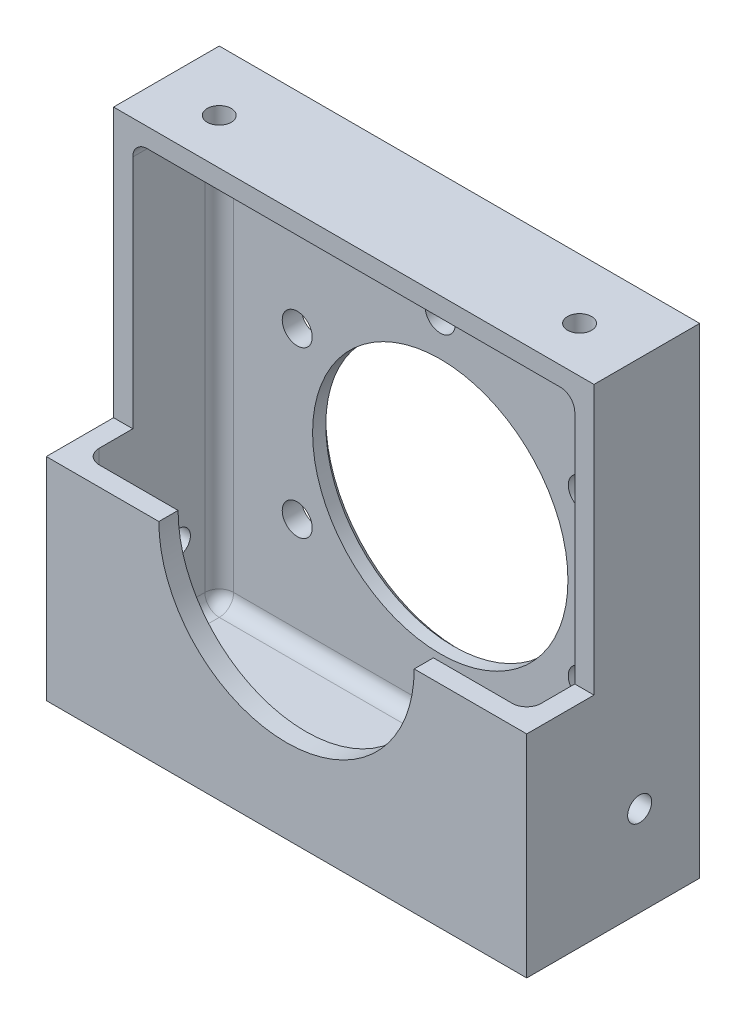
from build123d import *

# Parameters (mm, degrees)
SKETCH1_W            = 50.8
SKETCH1_H            = 50.8
MAIN_BODY_DEPTH      = 18.288
SKETCH2_W            = 7.112
SKETCH2_H            = 28.448
FRONT_CUT_DEPTH      = 75.133197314
SHELL1_T             = -2.032
SKETCH3_R            = 13.5001
CENTER_HOLE_DEPTH    = 75.133197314
FILL060_VERT_R       = 1.524
FILL060_TB_R         = 1.524
CHAM025_SIZE         = 0.635
DRILL010_TOP_REACH   = 76.133
SKETCH4_R            = 1.27
SKETCH6_R            = 1.27
DRILL010_SIDES_DEPTH = 75.133197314
DRILL125_REACH       = 76.133
SKETCH9_R            = 1.5875
HOLE_PATTERN_COUNT   = 6


with BuildPart() as part:
    # Sketch1 → main body (new body)
    with BuildSketch(Plane.XY):
        with Locations((25.4, 25.4)):
            Rectangle(SKETCH1_W, SKETCH1_H)
    extrude(amount=MAIN_BODY_DEPTH)

    # Sketch2 → front cut (cut, through all)
    with BuildSketch(Plane(origin=(50.8, 0, 0), x_dir=(0, 0, -1), z_dir=(1, 0, 0))):
        with Locations((-14.732, 36.576)):
            Rectangle(SKETCH2_W, SKETCH2_H)
    extrude(amount=-FRONT_CUT_DEPTH, mode=Mode.SUBTRACT)

    # Shell1
    shell1_openings = [part.faces().sort_by_distance(p)[0] for p in [
        (25.4, 36.576, 11.176),
        (25.4, 22.352, 14.732),
    ]]
    offset(amount=SHELL1_T, openings=shell1_openings, kind=Kind.INTERSECTION)

    # Sketch3 → center hole (cut, through all)
    with BuildSketch(Plane.XY):
        with Locations(Location((25.4, 22.352, 0), (0, 0, 180))):
            Circle(SKETCH3_R)
    extrude(amount=CENTER_HOLE_DEPTH, mode=Mode.SUBTRACT)

    # fill060.vert
    fill060_vert_edges = [part.edges().sort_by_distance(p)[0] for p in [
        (2.032, 12.192, 16.256),
        (48.768, 12.192, 16.256),
        (2.032, 25.4, 2.032),
        (48.768, 25.4, 2.032),
    ]]
    fillet(fill060_vert_edges, radius=FILL060_VERT_R)

    # fill060.tb
    fill060_tb_edges = [part.edges().sort_by_distance(p)[0] for p in [
        (2.032, 48.768, 7.366),
        (48.768, 48.768, 7.366),
        (2.032, 2.032, 9.144),
        (25.4, 48.768, 2.032),
        (48.321630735, 48.768, 2.478369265),
        (2.478369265, 48.768, 2.478369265),
        (25.4, 2.032, 2.032),
        (25.4, 2.032, 16.256),
        (48.768, 2.032, 9.144),
        (48.321630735, 2.032, 15.809630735),
        (48.321630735, 2.032, 2.478369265),
        (2.478369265, 2.032, 15.809630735),
        (2.478369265, 2.032, 2.478369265),
    ]]
    fillet(fill060_tb_edges, radius=FILL060_TB_R)

    # cham025
    cham025_edges = [part.edges().sort_by_distance(p)[0] for p in [
        (38.9001, 22.352, 0),
    ]]
    chamfer(cham025_edges, length=CHAM025_SIZE)

    # Sketch4 → drill010.top (cut, up to next)
    with BuildSketch(Plane(origin=(0, 50.8, 0), x_dir=(-1, 0, 0), z_dir=(0, 1, 0)), mode=Mode.PRIVATE) as drill010_top_sk1:
        with Locations((-44.45, 6.35)):
            Circle(SKETCH4_R)
    drill010_top_tool1 = extrude(drill010_top_sk1.sketch, amount=-DRILL010_TOP_REACH, mode=Mode.PRIVATE) & part.part
    # Sketch4 → drill010.top (cut, up to next)
    with BuildSketch(Plane(origin=(0, 50.8, 0), x_dir=(-1, 0, 0), z_dir=(0, 1, 0)), mode=Mode.PRIVATE) as drill010_top_sk2:
        with Locations((-6.35, 6.35)):
            Circle(SKETCH4_R)
    drill010_top_tool2 = extrude(drill010_top_sk2.sketch, amount=-DRILL010_TOP_REACH, mode=Mode.PRIVATE) & part.part
    add(drill010_top_tool1.solids().sort_by_distance((44.45, 50.8, 6.35))[0], mode=Mode.SUBTRACT)
    add(drill010_top_tool2.solids().sort_by_distance((6.35, 50.8, 6.35))[0], mode=Mode.SUBTRACT)

    # Sketch6 → drill010.sides (cut, through all)
    with BuildSketch(Plane(origin=(50.8, 0, 0), x_dir=(0, 0, -1), z_dir=(1, 0, 0))):
        with Locations(Location((-6.35, 9.525, 0), (0, 0, 90))):
            Circle(SKETCH6_R)
    extrude(amount=-DRILL010_SIDES_DEPTH, mode=Mode.SUBTRACT)

    # Sketch9 → drill125 (cut, up to next)
    with BuildSketch(Plane(origin=(0, 0, 0), x_dir=(-1, 0, 0), z_dir=(0, 0, -1)), mode=Mode.PRIVATE) as drill125_sk1:
        with Locations((-10.277031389, 31.083250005)):
            Circle(SKETCH9_R)
    drill125_tool1 = extrude(drill125_sk1.sketch, amount=-DRILL125_REACH, mode=Mode.PRIVATE) & part.part
    drill125 = drill125_tool1.solids().sort_by_distance((10.277031, 31.08325, 0))[0]
    add(drill125, mode=Mode.SUBTRACT)

    # hole pattern: drill125; each copy of drill125 runs up to whatever stops it at its own place
    hole_pattern_before = part.part  # the part as the pattern finds it: every copy runs up to it
    hole_pattern_drill125_long = extrude(drill125_sk1.sketch, amount=-DRILL125_REACH, mode=Mode.PRIVATE)
    hole_pattern_drill125_tool1 = hole_pattern_drill125_long.rotate(Axis((25.4, 22.352, 0), (0, 0, 1)), 1 * 360 / HOLE_PATTERN_COUNT) & hole_pattern_before
    add(hole_pattern_drill125_tool1.solids().sort_by_distance((10.277031, 13.62075, 0))[0], mode=Mode.SUBTRACT)
    hole_pattern_drill125_tool2 = hole_pattern_drill125_long.rotate(Axis((25.4, 22.352, 0), (0, 0, 1)), 2 * 360 / HOLE_PATTERN_COUNT) & hole_pattern_before
    add(hole_pattern_drill125_tool2.solids().sort_by_distance((25.4, 4.8895, 0))[0], mode=Mode.SUBTRACT)
    hole_pattern_drill125_tool3 = hole_pattern_drill125_long.rotate(Axis((25.4, 22.352, 0), (0, 0, 1)), 3 * 360 / HOLE_PATTERN_COUNT) & hole_pattern_before
    add(hole_pattern_drill125_tool3.solids().sort_by_distance((40.522969, 13.62075, 0))[0], mode=Mode.SUBTRACT)
    hole_pattern_drill125_tool4 = hole_pattern_drill125_long.rotate(Axis((25.4, 22.352, 0), (0, 0, 1)), 4 * 360 / HOLE_PATTERN_COUNT) & hole_pattern_before
    add(hole_pattern_drill125_tool4.solids().sort_by_distance((40.522969, 31.08325, 0))[0], mode=Mode.SUBTRACT)
    hole_pattern_drill125_tool5 = hole_pattern_drill125_long.rotate(Axis((25.4, 22.352, 0), (0, 0, 1)), 5 * 360 / HOLE_PATTERN_COUNT) & hole_pattern_before
    add(hole_pattern_drill125_tool5.solids().sort_by_distance((25.4, 39.8145, 0))[0], mode=Mode.SUBTRACT)


solid = part.part
